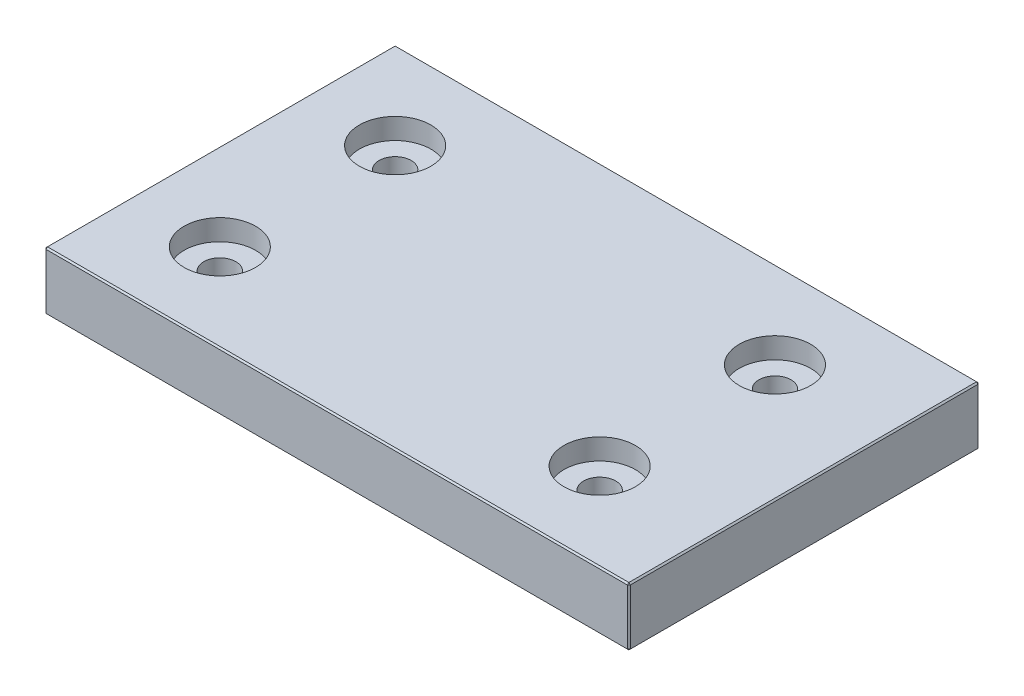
ISO-10303-21;
HEADER;
FILE_DESCRIPTION(('STEP AP214'),'2;1');
FILE_NAME('part.step','',(''),(''),'','','');
FILE_SCHEMA(('AUTOMOTIVE_DESIGN { 1 0 10303 214 1 1 1 1 }'));
ENDSEC;
DATA;
#1=APPLICATION_CONTEXT('core data for automotive mechanical design processes');
#2=APPLICATION_PROTOCOL_DEFINITION('international standard','automotive_design',2000,#1);
#3=PRODUCT_CONTEXT('',#1,'mechanical');
#4=PRODUCT('Part','Part','',(#3));
#5=PRODUCT_RELATED_PRODUCT_CATEGORY('part','',(#4));
#6=PRODUCT_DEFINITION_FORMATION('','',#4);
#7=PRODUCT_DEFINITION_CONTEXT('part definition',#1,'design');
#8=PRODUCT_DEFINITION('design','',#6,#7);
#9=PRODUCT_DEFINITION_SHAPE('','',#8);
#10=(LENGTH_UNIT() NAMED_UNIT(*) SI_UNIT(.MILLI.,.METRE.));
#11=(NAMED_UNIT(*) PLANE_ANGLE_UNIT() SI_UNIT($,.RADIAN.));
#12=(NAMED_UNIT(*) SI_UNIT($,.STERADIAN.) SOLID_ANGLE_UNIT());
#13=UNCERTAINTY_MEASURE_WITH_UNIT(LENGTH_MEASURE(1.E-05),#10,'distance_accuracy_value','');
#14=(GEOMETRIC_REPRESENTATION_CONTEXT(3) GLOBAL_UNCERTAINTY_ASSIGNED_CONTEXT((#13)) GLOBAL_UNIT_ASSIGNED_CONTEXT((#10,
#11,#12)) REPRESENTATION_CONTEXT('',''));
#15=CARTESIAN_POINT('',(0.,0.,0.));
#16=DIRECTION('',(0.,0.,1.));
#17=DIRECTION('',(1.,0.,0.));
#18=AXIS2_PLACEMENT_3D('',#15,#16,#17);
#19=CARTESIAN_POINT('',(30.,10.,-15.));
#20=DIRECTION('',(0.,1.,0.));
#21=DIRECTION('',(0.,0.,1.));
#22=AXIS2_PLACEMENT_3D('',#19,#20,#21);
#23=CYLINDRICAL_SURFACE('',#22,6.12);
#24=CARTESIAN_POINT('',(30.,6.42,-15.));
#25=DIRECTION('',(0.,1.,0.));
#26=DIRECTION('',(0.,0.,1.));
#27=AXIS2_PLACEMENT_3D('',#24,#25,#26);
#28=CIRCLE('',#27,6.12);
#29=CARTESIAN_POINT('',(30.,6.42,-8.88));
#30=VERTEX_POINT('',#29);
#31=EDGE_CURVE('E11',#30,#30,#28,.T.);
#32=ORIENTED_EDGE('',*,*,#31,.F.);
#33=EDGE_LOOP('',(#32));
#34=FACE_BOUND('',#33,.T.);
#35=CARTESIAN_POINT('',(30.,10.,-15.));
#36=DIRECTION('',(0.,1.,0.));
#37=DIRECTION('',(0.,0.,1.));
#38=AXIS2_PLACEMENT_3D('',#35,#36,#37);
#39=CIRCLE('',#38,6.12);
#40=CARTESIAN_POINT('',(30.,10.,-8.88));
#41=VERTEX_POINT('',#40);
#42=EDGE_CURVE('E211',#41,#41,#39,.T.);
#43=ORIENTED_EDGE('',*,*,#42,.T.);
#44=EDGE_LOOP('',(#43));
#45=FACE_BOUND('',#44,.T.);
#46=ADVANCED_FACE('F32',(#34,#45),#23,.F.);
#47=CARTESIAN_POINT('',(32.75,6.42,-15.));
#48=DIRECTION('',(0.,-1.,0.));
#49=DIRECTION('',(0.,0.,-1.));
#50=AXIS2_PLACEMENT_3D('',#47,#48,#49);
#51=PLANE('',#50);
#52=CARTESIAN_POINT('',(30.,6.42,-15.));
#53=DIRECTION('',(0.,1.,0.));
#54=DIRECTION('',(0.,0.,1.));
#55=AXIS2_PLACEMENT_3D('',#52,#53,#54);
#56=CIRCLE('',#55,2.75);
#57=CARTESIAN_POINT('',(30.,6.42,-12.25));
#58=VERTEX_POINT('',#57);
#59=EDGE_CURVE('E39',#58,#58,#56,.T.);
#60=ORIENTED_EDGE('',*,*,#59,.F.);
#61=EDGE_LOOP('',(#60));
#62=FACE_BOUND('',#61,.T.);
#63=ORIENTED_EDGE('',*,*,#31,.T.);
#64=EDGE_LOOP('',(#63));
#65=FACE_BOUND('',#64,.T.);
#66=ADVANCED_FACE('F221',(#62,#65),#51,.F.);
#67=CARTESIAN_POINT('',(30.,10.,-15.));
#68=DIRECTION('',(0.,1.,0.));
#69=DIRECTION('',(0.,0.,1.));
#70=AXIS2_PLACEMENT_3D('',#67,#68,#69);
#71=CYLINDRICAL_SURFACE('',#70,2.75000000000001);
#72=CARTESIAN_POINT('',(30.,0.,-15.));
#73=DIRECTION('',(0.,1.,0.));
#74=DIRECTION('',(0.,0.,1.));
#75=AXIS2_PLACEMENT_3D('',#72,#73,#74);
#76=CIRCLE('',#75,2.75000000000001);
#77=CARTESIAN_POINT('',(30.,0.,-12.25));
#78=VERTEX_POINT('',#77);
#79=EDGE_CURVE('E214',#78,#78,#76,.T.);
#80=ORIENTED_EDGE('',*,*,#79,.F.);
#81=EDGE_LOOP('',(#80));
#82=FACE_BOUND('',#81,.T.);
#83=ORIENTED_EDGE('',*,*,#59,.T.);
#84=EDGE_LOOP('',(#83));
#85=FACE_BOUND('',#84,.T.);
#86=ADVANCED_FACE('F219',(#82,#85),#71,.F.);
#87=CARTESIAN_POINT('',(-35.,10.,-15.));
#88=DIRECTION('',(0.,1.,0.));
#89=DIRECTION('',(0.,0.,1.));
#90=AXIS2_PLACEMENT_3D('',#87,#88,#89);
#91=CYLINDRICAL_SURFACE('',#90,6.12);
#92=CARTESIAN_POINT('',(-35.,6.42,-15.));
#93=DIRECTION('',(0.,1.,0.));
#94=DIRECTION('',(0.,0.,1.));
#95=AXIS2_PLACEMENT_3D('',#92,#93,#94);
#96=CIRCLE('',#95,6.12);
#97=CARTESIAN_POINT('',(-35.,6.42,-8.88));
#98=VERTEX_POINT('',#97);
#99=EDGE_CURVE('E208',#98,#98,#96,.T.);
#100=ORIENTED_EDGE('',*,*,#99,.F.);
#101=EDGE_LOOP('',(#100));
#102=FACE_BOUND('',#101,.T.);
#103=CARTESIAN_POINT('',(-35.,10.,-15.));
#104=DIRECTION('',(0.,1.,0.));
#105=DIRECTION('',(0.,0.,1.));
#106=AXIS2_PLACEMENT_3D('',#103,#104,#105);
#107=CIRCLE('',#106,6.12);
#108=CARTESIAN_POINT('',(-35.,10.,-8.88));
#109=VERTEX_POINT('',#108);
#110=EDGE_CURVE('E198',#109,#109,#107,.T.);
#111=ORIENTED_EDGE('',*,*,#110,.T.);
#112=EDGE_LOOP('',(#111));
#113=FACE_BOUND('',#112,.T.);
#114=ADVANCED_FACE('F340',(#102,#113),#91,.F.);
#115=CARTESIAN_POINT('',(-32.25,6.42,-15.));
#116=DIRECTION('',(0.,-1.,0.));
#117=DIRECTION('',(0.,0.,-1.));
#118=AXIS2_PLACEMENT_3D('',#115,#116,#117);
#119=PLANE('',#118);
#120=CARTESIAN_POINT('',(-35.,6.42,-15.));
#121=DIRECTION('',(0.,1.,0.));
#122=DIRECTION('',(0.,0.,1.));
#123=AXIS2_PLACEMENT_3D('',#120,#121,#122);
#124=CIRCLE('',#123,2.75);
#125=CARTESIAN_POINT('',(-35.,6.42,-12.25));
#126=VERTEX_POINT('',#125);
#127=EDGE_CURVE('E205',#126,#126,#124,.T.);
#128=ORIENTED_EDGE('',*,*,#127,.F.);
#129=EDGE_LOOP('',(#128));
#130=FACE_BOUND('',#129,.T.);
#131=ORIENTED_EDGE('',*,*,#99,.T.);
#132=EDGE_LOOP('',(#131));
#133=FACE_BOUND('',#132,.T.);
#134=ADVANCED_FACE('F336',(#130,#133),#119,.F.);
#135=CARTESIAN_POINT('',(-35.,10.,-15.));
#136=DIRECTION('',(0.,1.,0.));
#137=DIRECTION('',(0.,0.,1.));
#138=AXIS2_PLACEMENT_3D('',#135,#136,#137);
#139=CYLINDRICAL_SURFACE('',#138,2.75000000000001);
#140=CARTESIAN_POINT('',(-35.,0.,-15.));
#141=DIRECTION('',(0.,1.,0.));
#142=DIRECTION('',(0.,0.,1.));
#143=AXIS2_PLACEMENT_3D('',#140,#141,#142);
#144=CIRCLE('',#143,2.75000000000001);
#145=CARTESIAN_POINT('',(-35.,0.,-12.25));
#146=VERTEX_POINT('',#145);
#147=EDGE_CURVE('E201',#146,#146,#144,.T.);
#148=ORIENTED_EDGE('',*,*,#147,.F.);
#149=EDGE_LOOP('',(#148));
#150=FACE_BOUND('',#149,.T.);
#151=ORIENTED_EDGE('',*,*,#127,.T.);
#152=EDGE_LOOP('',(#151));
#153=FACE_BOUND('',#152,.T.);
#154=ADVANCED_FACE('F259',(#150,#153),#139,.F.);
#155=CARTESIAN_POINT('',(50.,10.,30.));
#156=DIRECTION('',(-1.,0.,0.));
#157=DIRECTION('',(0.,0.,1.));
#158=AXIS2_PLACEMENT_3D('',#155,#156,#157);
#159=PLANE('',#158);
#160=DIRECTION('',(0.,0.,-1.));
#161=VECTOR('',#160,1.);
#162=CARTESIAN_POINT('',(50.,0.25,-30.));
#163=LINE('',#162,#161);
#164=CARTESIAN_POINT('',(50.,0.25,29.75));
#165=VERTEX_POINT('',#164);
#166=CARTESIAN_POINT('',(50.,0.25,-29.75));
#167=VERTEX_POINT('',#166);
#168=EDGE_CURVE('E633',#165,#167,#163,.T.);
#169=ORIENTED_EDGE('',*,*,#168,.T.);
#170=DIRECTION('',(0.,1.,0.));
#171=VECTOR('',#170,1.);
#172=CARTESIAN_POINT('',(50.,10.,-29.75));
#173=LINE('',#172,#171);
#174=CARTESIAN_POINT('',(50.,9.75,-29.75));
#175=VERTEX_POINT('',#174);
#176=EDGE_CURVE('E635',#167,#175,#173,.T.);
#177=ORIENTED_EDGE('',*,*,#176,.T.);
#178=DIRECTION('',(0.,0.,1.));
#179=VECTOR('',#178,1.);
#180=CARTESIAN_POINT('',(50.,9.75,30.));
#181=LINE('',#180,#179);
#182=CARTESIAN_POINT('',(50.,9.75,29.75));
#183=VERTEX_POINT('',#182);
#184=EDGE_CURVE('E631',#175,#183,#181,.T.);
#185=ORIENTED_EDGE('',*,*,#184,.T.);
#186=DIRECTION('',(0.,-1.,0.));
#187=VECTOR('',#186,1.);
#188=CARTESIAN_POINT('',(50.,10.,29.75));
#189=LINE('',#188,#187);
#190=EDGE_CURVE('E629',#183,#165,#189,.T.);
#191=ORIENTED_EDGE('',*,*,#190,.T.);
#192=EDGE_LOOP('',(#169,#177,#185,#191));
#193=FACE_BOUND('',#192,.T.);
#194=ADVANCED_FACE('F256',(#193),#159,.F.);
#195=CARTESIAN_POINT('',(-50.,10.,-30.));
#196=DIRECTION('',(0.,0.,1.));
#197=DIRECTION('',(1.,0.,0.));
#198=AXIS2_PLACEMENT_3D('',#195,#196,#197);
#199=PLANE('',#198);
#200=DIRECTION('',(0.,-1.,0.));
#201=VECTOR('',#200,1.);
#202=CARTESIAN_POINT('',(49.75,10.,-30.));
#203=LINE('',#202,#201);
#204=CARTESIAN_POINT('',(49.75,9.75,-30.));
#205=VERTEX_POINT('',#204);
#206=CARTESIAN_POINT('',(49.75,0.25,-30.));
#207=VERTEX_POINT('',#206);
#208=EDGE_CURVE('E129',#205,#207,#203,.T.);
#209=ORIENTED_EDGE('',*,*,#208,.T.);
#210=DIRECTION('',(-1.,0.,0.));
#211=VECTOR('',#210,1.);
#212=CARTESIAN_POINT('',(-50.,0.25,-30.));
#213=LINE('',#212,#211);
#214=CARTESIAN_POINT('',(-49.75,0.25,-30.));
#215=VERTEX_POINT('',#214);
#216=EDGE_CURVE('E125',#207,#215,#213,.T.);
#217=ORIENTED_EDGE('',*,*,#216,.T.);
#218=DIRECTION('',(0.,1.,0.));
#219=VECTOR('',#218,1.);
#220=CARTESIAN_POINT('',(-49.75,10.,-30.));
#221=LINE('',#220,#219);
#222=CARTESIAN_POINT('',(-49.75,9.75,-30.));
#223=VERTEX_POINT('',#222);
#224=EDGE_CURVE('E119',#215,#223,#221,.T.);
#225=ORIENTED_EDGE('',*,*,#224,.T.);
#226=DIRECTION('',(1.,0.,0.));
#227=VECTOR('',#226,1.);
#228=CARTESIAN_POINT('',(-50.,9.75,-30.));
#229=LINE('',#228,#227);
#230=EDGE_CURVE('E122',#223,#205,#229,.T.);
#231=ORIENTED_EDGE('',*,*,#230,.T.);
#232=EDGE_LOOP('',(#209,#217,#225,#231));
#233=FACE_BOUND('',#232,.T.);
#234=ADVANCED_FACE('F121',(#233),#199,.F.);
#235=CARTESIAN_POINT('',(-50.,10.,30.));
#236=DIRECTION('',(1.,0.,0.));
#237=DIRECTION('',(0.,0.,-1.));
#238=AXIS2_PLACEMENT_3D('',#235,#236,#237);
#239=PLANE('',#238);
#240=DIRECTION('',(0.,0.,-1.));
#241=VECTOR('',#240,1.);
#242=CARTESIAN_POINT('',(-50.,9.75,30.));
#243=LINE('',#242,#241);
#244=CARTESIAN_POINT('',(-50.,9.75,29.75));
#245=VERTEX_POINT('',#244);
#246=CARTESIAN_POINT('',(-50.,9.75,-29.75));
#247=VERTEX_POINT('',#246);
#248=EDGE_CURVE('E624',#245,#247,#243,.T.);
#249=ORIENTED_EDGE('',*,*,#248,.T.);
#250=DIRECTION('',(0.,-1.,0.));
#251=VECTOR('',#250,1.);
#252=CARTESIAN_POINT('',(-50.,10.,-29.75));
#253=LINE('',#252,#251);
#254=CARTESIAN_POINT('',(-50.,0.25,-29.75));
#255=VERTEX_POINT('',#254);
#256=EDGE_CURVE('E153',#247,#255,#253,.T.);
#257=ORIENTED_EDGE('',*,*,#256,.T.);
#258=DIRECTION('',(0.,0.,1.));
#259=VECTOR('',#258,1.);
#260=CARTESIAN_POINT('',(-50.,0.25,30.));
#261=LINE('',#260,#259);
#262=CARTESIAN_POINT('',(-50.,0.25,29.75));
#263=VERTEX_POINT('',#262);
#264=EDGE_CURVE('E626',#255,#263,#261,.T.);
#265=ORIENTED_EDGE('',*,*,#264,.T.);
#266=DIRECTION('',(0.,1.,0.));
#267=VECTOR('',#266,1.);
#268=CARTESIAN_POINT('',(-50.,10.,29.75));
#269=LINE('',#268,#267);
#270=EDGE_CURVE('E622',#263,#245,#269,.T.);
#271=ORIENTED_EDGE('',*,*,#270,.T.);
#272=EDGE_LOOP('',(#249,#257,#265,#271));
#273=FACE_BOUND('',#272,.T.);
#274=ADVANCED_FACE('F243',(#273),#239,.F.);
#275=CARTESIAN_POINT('',(-50.,10.,30.));
#276=DIRECTION('',(0.,0.,-1.));
#277=DIRECTION('',(-1.,0.,0.));
#278=AXIS2_PLACEMENT_3D('',#275,#276,#277);
#279=PLANE('',#278);
#280=DIRECTION('',(-1.,0.,0.));
#281=VECTOR('',#280,1.);
#282=CARTESIAN_POINT('',(-50.,9.75,30.));
#283=LINE('',#282,#281);
#284=CARTESIAN_POINT('',(49.75,9.75,30.));
#285=VERTEX_POINT('',#284);
#286=CARTESIAN_POINT('',(-49.75,9.75,30.));
#287=VERTEX_POINT('',#286);
#288=EDGE_CURVE('E46',#285,#287,#283,.T.);
#289=ORIENTED_EDGE('',*,*,#288,.T.);
#290=DIRECTION('',(0.,-1.,0.));
#291=VECTOR('',#290,1.);
#292=CARTESIAN_POINT('',(-49.75,10.,30.));
#293=LINE('',#292,#291);
#294=CARTESIAN_POINT('',(-49.75,0.25,30.));
#295=VERTEX_POINT('',#294);
#296=EDGE_CURVE('E202',#287,#295,#293,.T.);
#297=ORIENTED_EDGE('',*,*,#296,.T.);
#298=DIRECTION('',(1.,0.,0.));
#299=VECTOR('',#298,1.);
#300=CARTESIAN_POINT('',(50.,0.25,30.));
#301=LINE('',#300,#299);
#302=CARTESIAN_POINT('',(49.75,0.25,30.));
#303=VERTEX_POINT('',#302);
#304=EDGE_CURVE('E647',#295,#303,#301,.T.);
#305=ORIENTED_EDGE('',*,*,#304,.T.);
#306=DIRECTION('',(0.,1.,0.));
#307=VECTOR('',#306,1.);
#308=CARTESIAN_POINT('',(49.75,10.,30.));
#309=LINE('',#308,#307);
#310=EDGE_CURVE('E51',#303,#285,#309,.T.);
#311=ORIENTED_EDGE('',*,*,#310,.T.);
#312=EDGE_LOOP('',(#289,#297,#305,#311));
#313=FACE_BOUND('',#312,.T.);
#314=ADVANCED_FACE('F233',(#313),#279,.F.);
#315=CARTESIAN_POINT('',(0.,10.,0.));
#316=DIRECTION('',(0.,-1.,0.));
#317=DIRECTION('',(0.,0.,-1.));
#318=AXIS2_PLACEMENT_3D('',#315,#316,#317);
#319=PLANE('',#318);
#320=CARTESIAN_POINT('',(30.,10.,15.));
#321=DIRECTION('',(0.,1.,0.));
#322=DIRECTION('',(0.,0.,1.));
#323=AXIS2_PLACEMENT_3D('',#320,#321,#322);
#324=CIRCLE('',#323,6.12);
#325=CARTESIAN_POINT('',(30.,10.,21.12));
#326=VERTEX_POINT('',#325);
#327=EDGE_CURVE('E588',#326,#326,#324,.T.);
#328=ORIENTED_EDGE('',*,*,#327,.F.);
#329=EDGE_LOOP('',(#328));
#330=FACE_BOUND('',#329,.T.);
#331=CARTESIAN_POINT('',(-35.,10.,15.));
#332=DIRECTION('',(0.,1.,0.));
#333=DIRECTION('',(0.,0.,1.));
#334=AXIS2_PLACEMENT_3D('',#331,#332,#333);
#335=CIRCLE('',#334,6.12);
#336=CARTESIAN_POINT('',(-35.,10.,21.12));
#337=VERTEX_POINT('',#336);
#338=EDGE_CURVE('E598',#337,#337,#335,.T.);
#339=ORIENTED_EDGE('',*,*,#338,.F.);
#340=EDGE_LOOP('',(#339));
#341=FACE_BOUND('',#340,.T.);
#342=DIRECTION('',(-1.,0.,0.));
#343=VECTOR('',#342,1.);
#344=CARTESIAN_POINT('',(0.,10.,-29.75));
#345=LINE('',#344,#343);
#346=CARTESIAN_POINT('',(49.75,10.,-29.75));
#347=VERTEX_POINT('',#346);
#348=CARTESIAN_POINT('',(-49.75,10.,-29.75));
#349=VERTEX_POINT('',#348);
#350=EDGE_CURVE('E642',#347,#349,#345,.T.);
#351=ORIENTED_EDGE('',*,*,#350,.T.);
#352=DIRECTION('',(0.,0.,1.));
#353=VECTOR('',#352,1.);
#354=CARTESIAN_POINT('',(-49.75,10.,0.));
#355=LINE('',#354,#353);
#356=CARTESIAN_POINT('',(-49.75,10.,29.75));
#357=VERTEX_POINT('',#356);
#358=EDGE_CURVE('E644',#349,#357,#355,.T.);
#359=ORIENTED_EDGE('',*,*,#358,.T.);
#360=DIRECTION('',(1.,0.,0.));
#361=VECTOR('',#360,1.);
#362=CARTESIAN_POINT('',(0.,10.,29.75));
#363=LINE('',#362,#361);
#364=CARTESIAN_POINT('',(49.75,10.,29.75));
#365=VERTEX_POINT('',#364);
#366=EDGE_CURVE('E638',#357,#365,#363,.T.);
#367=ORIENTED_EDGE('',*,*,#366,.T.);
#368=DIRECTION('',(0.,0.,-1.));
#369=VECTOR('',#368,1.);
#370=CARTESIAN_POINT('',(49.75,10.,0.));
#371=LINE('',#370,#369);
#372=EDGE_CURVE('E640',#365,#347,#371,.T.);
#373=ORIENTED_EDGE('',*,*,#372,.T.);
#374=EDGE_LOOP('',(#351,#359,#367,#373));
#375=FACE_BOUND('',#374,.T.);
#376=ORIENTED_EDGE('',*,*,#110,.F.);
#377=EDGE_LOOP('',(#376));
#378=FACE_BOUND('',#377,.T.);
#379=ORIENTED_EDGE('',*,*,#42,.F.);
#380=EDGE_LOOP('',(#379));
#381=FACE_BOUND('',#380,.T.);
#382=ADVANCED_FACE('F230',(#330,#341,#375,#378,#381),#319,.F.);
#383=CARTESIAN_POINT('',(0.,0.,0.));
#384=DIRECTION('',(0.,-1.,0.));
#385=DIRECTION('',(0.,0.,-1.));
#386=AXIS2_PLACEMENT_3D('',#383,#384,#385);
#387=PLANE('',#386);
#388=CARTESIAN_POINT('',(30.,0.,15.));
#389=DIRECTION('',(0.,1.,0.));
#390=DIRECTION('',(0.,0.,1.));
#391=AXIS2_PLACEMENT_3D('',#388,#389,#390);
#392=CIRCLE('',#391,2.75000000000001);
#393=CARTESIAN_POINT('',(30.,0.,17.75));
#394=VERTEX_POINT('',#393);
#395=EDGE_CURVE('E589',#394,#394,#392,.T.);
#396=ORIENTED_EDGE('',*,*,#395,.T.);
#397=EDGE_LOOP('',(#396));
#398=FACE_BOUND('',#397,.T.);
#399=CARTESIAN_POINT('',(-35.,0.,15.));
#400=DIRECTION('',(0.,1.,0.));
#401=DIRECTION('',(0.,0.,1.));
#402=AXIS2_PLACEMENT_3D('',#399,#400,#401);
#403=CIRCLE('',#402,2.75000000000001);
#404=CARTESIAN_POINT('',(-35.,0.,17.75));
#405=VERTEX_POINT('',#404);
#406=EDGE_CURVE('E607',#405,#405,#403,.T.);
#407=ORIENTED_EDGE('',*,*,#406,.T.);
#408=EDGE_LOOP('',(#407));
#409=FACE_BOUND('',#408,.T.);
#410=DIRECTION('',(0.,0.,-1.));
#411=VECTOR('',#410,1.);
#412=CARTESIAN_POINT('',(-49.75,0.,-30.));
#413=LINE('',#412,#411);
#414=CARTESIAN_POINT('',(-49.75,0.,29.75));
#415=VERTEX_POINT('',#414);
#416=CARTESIAN_POINT('',(-49.75,0.,-29.75));
#417=VERTEX_POINT('',#416);
#418=EDGE_CURVE('E617',#415,#417,#413,.T.);
#419=ORIENTED_EDGE('',*,*,#418,.T.);
#420=DIRECTION('',(1.,0.,0.));
#421=VECTOR('',#420,1.);
#422=CARTESIAN_POINT('',(50.,0.,-29.75));
#423=LINE('',#422,#421);
#424=CARTESIAN_POINT('',(49.75,0.,-29.75));
#425=VERTEX_POINT('',#424);
#426=EDGE_CURVE('E619',#417,#425,#423,.T.);
#427=ORIENTED_EDGE('',*,*,#426,.T.);
#428=DIRECTION('',(0.,0.,1.));
#429=VECTOR('',#428,1.);
#430=CARTESIAN_POINT('',(49.75,0.,30.));
#431=LINE('',#430,#429);
#432=CARTESIAN_POINT('',(49.75,0.,29.75));
#433=VERTEX_POINT('',#432);
#434=EDGE_CURVE('E615',#425,#433,#431,.T.);
#435=ORIENTED_EDGE('',*,*,#434,.T.);
#436=DIRECTION('',(-1.,0.,0.));
#437=VECTOR('',#436,1.);
#438=CARTESIAN_POINT('',(-50.,0.,29.75));
#439=LINE('',#438,#437);
#440=EDGE_CURVE('E613',#433,#415,#439,.T.);
#441=ORIENTED_EDGE('',*,*,#440,.T.);
#442=EDGE_LOOP('',(#419,#427,#435,#441));
#443=FACE_BOUND('',#442,.T.);
#444=ORIENTED_EDGE('',*,*,#147,.T.);
#445=EDGE_LOOP('',(#444));
#446=FACE_BOUND('',#445,.T.);
#447=ORIENTED_EDGE('',*,*,#79,.T.);
#448=EDGE_LOOP('',(#447));
#449=FACE_BOUND('',#448,.T.);
#450=ADVANCED_FACE('F232',(#398,#409,#443,#446,#449),#387,.T.);
#451=CARTESIAN_POINT('',(0.,10.,29.75));
#452=DIRECTION('',(0.,-0.707106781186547,-0.707106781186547));
#453=DIRECTION('',(1.,0.,0.));
#454=AXIS2_PLACEMENT_3D('',#451,#452,#453);
#455=PLANE('',#454);
#456=DIRECTION('',(0.,0.707106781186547,-0.707106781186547));
#457=VECTOR('',#456,1.);
#458=CARTESIAN_POINT('',(49.75,9.875,29.875));
#459=LINE('',#458,#457);
#460=EDGE_CURVE('E141',#365,#285,#459,.F.);
#461=ORIENTED_EDGE('',*,*,#460,.F.);
#462=ORIENTED_EDGE('',*,*,#366,.F.);
#463=DIRECTION('',(0.,-0.707106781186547,0.707106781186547));
#464=VECTOR('',#463,1.);
#465=CARTESIAN_POINT('',(-49.75,10.,29.75));
#466=LINE('',#465,#464);
#467=EDGE_CURVE('E193',#287,#357,#466,.F.);
#468=ORIENTED_EDGE('',*,*,#467,.F.);
#469=ORIENTED_EDGE('',*,*,#288,.F.);
#470=EDGE_LOOP('',(#461,#462,#468,#469));
#471=FACE_BOUND('',#470,.T.);
#472=ADVANCED_FACE('F240',(#471),#455,.F.);
#473=CARTESIAN_POINT('',(50.,9.75,29.75));
#474=DIRECTION('',(0.577350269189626,0.577350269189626,0.577350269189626));
#475=DIRECTION('',(0.707106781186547,0.,-0.707106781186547));
#476=AXIS2_PLACEMENT_3D('',#473,#474,#475);
#477=PLANE('',#476);
#478=DIRECTION('',(0.707106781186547,-0.707106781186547,0.));
#479=VECTOR('',#478,1.);
#480=CARTESIAN_POINT('',(50.,9.75,29.75));
#481=LINE('',#480,#479);
#482=EDGE_CURVE('E187',#365,#183,#481,.T.);
#483=ORIENTED_EDGE('',*,*,#482,.F.);
#484=ORIENTED_EDGE('',*,*,#460,.T.);
#485=DIRECTION('',(-0.707106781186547,0.,0.707106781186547));
#486=VECTOR('',#485,1.);
#487=CARTESIAN_POINT('',(50.,9.75,29.75));
#488=LINE('',#487,#486);
#489=EDGE_CURVE('E190',#183,#285,#488,.T.);
#490=ORIENTED_EDGE('',*,*,#489,.F.);
#491=EDGE_LOOP('',(#483,#484,#490));
#492=FACE_BOUND('',#491,.T.);
#493=ADVANCED_FACE('F326',(#492),#477,.T.);
#494=CARTESIAN_POINT('',(-49.75,10.,29.75));
#495=DIRECTION('',(-0.577350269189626,0.577350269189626,0.577350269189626));
#496=DIRECTION('',(0.707106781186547,0.,0.707106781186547));
#497=AXIS2_PLACEMENT_3D('',#494,#495,#496);
#498=PLANE('',#497);
#499=DIRECTION('',(-0.707106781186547,0.,-0.707106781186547));
#500=VECTOR('',#499,1.);
#501=CARTESIAN_POINT('',(-49.875,9.75,29.875));
#502=LINE('',#501,#500);
#503=EDGE_CURVE('E182',#287,#245,#502,.T.);
#504=ORIENTED_EDGE('',*,*,#503,.F.);
#505=ORIENTED_EDGE('',*,*,#467,.T.);
#506=DIRECTION('',(0.707106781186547,0.707106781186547,0.));
#507=VECTOR('',#506,1.);
#508=CARTESIAN_POINT('',(-49.75,10.,29.75));
#509=LINE('',#508,#507);
#510=EDGE_CURVE('E185',#245,#357,#509,.T.);
#511=ORIENTED_EDGE('',*,*,#510,.F.);
#512=EDGE_LOOP('',(#504,#505,#511));
#513=FACE_BOUND('',#512,.T.);
#514=ADVANCED_FACE('F322',(#513),#498,.T.);
#515=CARTESIAN_POINT('',(50.,10.,29.75));
#516=DIRECTION('',(-0.707106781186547,0.,-0.707106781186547));
#517=DIRECTION('',(0.,-1.,0.));
#518=AXIS2_PLACEMENT_3D('',#515,#516,#517);
#519=PLANE('',#518);
#520=ORIENTED_EDGE('',*,*,#489,.T.);
#521=ORIENTED_EDGE('',*,*,#310,.F.);
#522=DIRECTION('',(0.707106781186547,0.,-0.707106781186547));
#523=VECTOR('',#522,1.);
#524=CARTESIAN_POINT('',(49.875,0.25,29.875));
#525=LINE('',#524,#523);
#526=EDGE_CURVE('E176',#165,#303,#525,.F.);
#527=ORIENTED_EDGE('',*,*,#526,.F.);
#528=ORIENTED_EDGE('',*,*,#190,.F.);
#529=EDGE_LOOP('',(#520,#521,#527,#528));
#530=FACE_BOUND('',#529,.T.);
#531=ADVANCED_FACE('F318',(#530),#519,.F.);
#532=CARTESIAN_POINT('',(49.75,10.,0.));
#533=DIRECTION('',(-0.707106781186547,-0.707106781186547,0.));
#534=DIRECTION('',(0.,0.,-1.));
#535=AXIS2_PLACEMENT_3D('',#532,#533,#534);
#536=PLANE('',#535);
#537=ORIENTED_EDGE('',*,*,#482,.T.);
#538=ORIENTED_EDGE('',*,*,#184,.F.);
#539=DIRECTION('',(-0.707106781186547,0.707106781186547,0.));
#540=VECTOR('',#539,1.);
#541=CARTESIAN_POINT('',(50.,9.75,-29.75));
#542=LINE('',#541,#540);
#543=EDGE_CURVE('E173',#347,#175,#542,.F.);
#544=ORIENTED_EDGE('',*,*,#543,.F.);
#545=ORIENTED_EDGE('',*,*,#372,.F.);
#546=EDGE_LOOP('',(#537,#538,#544,#545));
#547=FACE_BOUND('',#546,.T.);
#548=ADVANCED_FACE('F315',(#547),#536,.F.);
#549=CARTESIAN_POINT('',(0.,10.,-29.75));
#550=DIRECTION('',(0.,-0.707106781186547,0.707106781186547));
#551=DIRECTION('',(-1.,0.,0.));
#552=AXIS2_PLACEMENT_3D('',#549,#550,#551);
#553=PLANE('',#552);
#554=DIRECTION('',(0.,0.707106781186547,0.707106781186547));
#555=VECTOR('',#554,1.);
#556=CARTESIAN_POINT('',(-49.75,9.75,-30.));
#557=LINE('',#556,#555);
#558=EDGE_CURVE('E136',#349,#223,#557,.F.);
#559=ORIENTED_EDGE('',*,*,#558,.F.);
#560=ORIENTED_EDGE('',*,*,#350,.F.);
#561=DIRECTION('',(0.,-0.707106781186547,-0.707106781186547));
#562=VECTOR('',#561,1.);
#563=CARTESIAN_POINT('',(49.75,9.875,-29.875));
#564=LINE('',#563,#562);
#565=EDGE_CURVE('E139',#205,#347,#564,.F.);
#566=ORIENTED_EDGE('',*,*,#565,.F.);
#567=ORIENTED_EDGE('',*,*,#230,.F.);
#568=EDGE_LOOP('',(#559,#560,#566,#567));
#569=FACE_BOUND('',#568,.T.);
#570=ADVANCED_FACE('F134',(#569),#553,.F.);
#571=CARTESIAN_POINT('',(-49.75,10.,0.));
#572=DIRECTION('',(0.707106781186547,-0.707106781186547,0.));
#573=DIRECTION('',(0.,0.,1.));
#574=AXIS2_PLACEMENT_3D('',#571,#572,#573);
#575=PLANE('',#574);
#576=ORIENTED_EDGE('',*,*,#510,.T.);
#577=ORIENTED_EDGE('',*,*,#358,.F.);
#578=DIRECTION('',(-0.707106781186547,-0.707106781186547,0.));
#579=VECTOR('',#578,1.);
#580=CARTESIAN_POINT('',(-49.875,9.875,-29.75));
#581=LINE('',#580,#579);
#582=EDGE_CURVE('E149',#247,#349,#581,.F.);
#583=ORIENTED_EDGE('',*,*,#582,.F.);
#584=ORIENTED_EDGE('',*,*,#248,.F.);
#585=EDGE_LOOP('',(#576,#577,#583,#584));
#586=FACE_BOUND('',#585,.T.);
#587=ADVANCED_FACE('F308',(#586),#575,.F.);
#588=CARTESIAN_POINT('',(-49.75,10.,30.));
#589=DIRECTION('',(0.707106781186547,0.,-0.707106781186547));
#590=DIRECTION('',(0.,-1.,0.));
#591=AXIS2_PLACEMENT_3D('',#588,#589,#590);
#592=PLANE('',#591);
#593=ORIENTED_EDGE('',*,*,#503,.T.);
#594=ORIENTED_EDGE('',*,*,#270,.F.);
#595=DIRECTION('',(0.707106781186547,0.,0.707106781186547));
#596=VECTOR('',#595,1.);
#597=CARTESIAN_POINT('',(-50.,0.25,29.75));
#598=LINE('',#597,#596);
#599=EDGE_CURVE('E168',#295,#263,#598,.F.);
#600=ORIENTED_EDGE('',*,*,#599,.F.);
#601=ORIENTED_EDGE('',*,*,#296,.F.);
#602=EDGE_LOOP('',(#593,#594,#600,#601));
#603=FACE_BOUND('',#602,.T.);
#604=ADVANCED_FACE('F304',(#603),#592,.F.);
#605=CARTESIAN_POINT('',(-50.,0.25,30.));
#606=DIRECTION('',(0.,-0.707106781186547,0.707106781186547));
#607=DIRECTION('',(-1.,0.,0.));
#608=AXIS2_PLACEMENT_3D('',#605,#606,#607);
#609=PLANE('',#608);
#610=DIRECTION('',(0.,-0.707106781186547,-0.707106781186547));
#611=VECTOR('',#610,1.);
#612=CARTESIAN_POINT('',(49.75,0.,29.75));
#613=LINE('',#612,#611);
#614=EDGE_CURVE('E179',#303,#433,#613,.T.);
#615=ORIENTED_EDGE('',*,*,#614,.F.);
#616=ORIENTED_EDGE('',*,*,#304,.F.);
#617=DIRECTION('',(0.,0.707106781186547,0.707106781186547));
#618=VECTOR('',#617,1.);
#619=CARTESIAN_POINT('',(-49.75,0.125,29.875));
#620=LINE('',#619,#618);
#621=EDGE_CURVE('E166',#415,#295,#620,.T.);
#622=ORIENTED_EDGE('',*,*,#621,.F.);
#623=ORIENTED_EDGE('',*,*,#440,.F.);
#624=EDGE_LOOP('',(#615,#616,#622,#623));
#625=FACE_BOUND('',#624,.T.);
#626=ADVANCED_FACE('F300',(#625),#609,.T.);
#627=CARTESIAN_POINT('',(49.75,0.,29.75));
#628=DIRECTION('',(0.577350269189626,-0.577350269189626,0.577350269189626));
#629=DIRECTION('',(0.707106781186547,0.,-0.707106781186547));
#630=AXIS2_PLACEMENT_3D('',#627,#628,#629);
#631=PLANE('',#630);
#632=ORIENTED_EDGE('',*,*,#526,.T.);
#633=ORIENTED_EDGE('',*,*,#614,.T.);
#634=DIRECTION('',(0.707106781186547,0.707106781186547,0.));
#635=VECTOR('',#634,1.);
#636=CARTESIAN_POINT('',(49.75,0.,29.75));
#637=LINE('',#636,#635);
#638=EDGE_CURVE('E157',#165,#433,#637,.F.);
#639=ORIENTED_EDGE('',*,*,#638,.F.);
#640=EDGE_LOOP('',(#632,#633,#639));
#641=FACE_BOUND('',#640,.T.);
#642=ADVANCED_FACE('F296',(#641),#631,.T.);
#643=CARTESIAN_POINT('',(50.,9.75,-29.75));
#644=DIRECTION('',(0.577350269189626,0.577350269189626,-0.577350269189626));
#645=DIRECTION('',(-0.707106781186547,0.,-0.707106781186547));
#646=AXIS2_PLACEMENT_3D('',#643,#644,#645);
#647=PLANE('',#646);
#648=ORIENTED_EDGE('',*,*,#565,.T.);
#649=ORIENTED_EDGE('',*,*,#543,.T.);
#650=DIRECTION('',(0.707106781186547,0.,0.707106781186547));
#651=VECTOR('',#650,1.);
#652=CARTESIAN_POINT('',(50.,9.75,-29.75));
#653=LINE('',#652,#651);
#654=EDGE_CURVE('E154',#205,#175,#653,.T.);
#655=ORIENTED_EDGE('',*,*,#654,.F.);
#656=EDGE_LOOP('',(#648,#649,#655));
#657=FACE_BOUND('',#656,.T.);
#658=ADVANCED_FACE('F293',(#657),#647,.T.);
#659=CARTESIAN_POINT('',(-49.75,9.75,-30.));
#660=DIRECTION('',(-0.577350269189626,0.577350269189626,-0.577350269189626));
#661=DIRECTION('',(-0.707106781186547,0.,0.707106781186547));
#662=AXIS2_PLACEMENT_3D('',#659,#660,#661);
#663=PLANE('',#662);
#664=ORIENTED_EDGE('',*,*,#582,.T.);
#665=ORIENTED_EDGE('',*,*,#558,.T.);
#666=DIRECTION('',(0.707106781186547,0.,-0.707106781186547));
#667=VECTOR('',#666,1.);
#668=CARTESIAN_POINT('',(-49.75,9.75,-30.));
#669=LINE('',#668,#667);
#670=EDGE_CURVE('E146',#247,#223,#669,.T.);
#671=ORIENTED_EDGE('',*,*,#670,.F.);
#672=EDGE_LOOP('',(#664,#665,#671));
#673=FACE_BOUND('',#672,.T.);
#674=ADVANCED_FACE('F145',(#673),#663,.T.);
#675=CARTESIAN_POINT('',(-50.,0.25,29.75));
#676=DIRECTION('',(-0.577350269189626,-0.577350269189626,0.577350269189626));
#677=DIRECTION('',(0.707106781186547,0.,0.707106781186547));
#678=AXIS2_PLACEMENT_3D('',#675,#676,#677);
#679=PLANE('',#678);
#680=ORIENTED_EDGE('',*,*,#621,.T.);
#681=ORIENTED_EDGE('',*,*,#599,.T.);
#682=DIRECTION('',(0.707106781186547,-0.707106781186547,0.));
#683=VECTOR('',#682,1.);
#684=CARTESIAN_POINT('',(-50.,0.25,29.75));
#685=LINE('',#684,#683);
#686=EDGE_CURVE('E155',#415,#263,#685,.F.);
#687=ORIENTED_EDGE('',*,*,#686,.F.);
#688=EDGE_LOOP('',(#680,#681,#687));
#689=FACE_BOUND('',#688,.T.);
#690=ADVANCED_FACE('F286',(#689),#679,.T.);
#691=CARTESIAN_POINT('',(50.,0.25,30.));
#692=DIRECTION('',(0.707106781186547,-0.707106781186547,0.));
#693=DIRECTION('',(0.,0.,1.));
#694=AXIS2_PLACEMENT_3D('',#691,#692,#693);
#695=PLANE('',#694);
#696=ORIENTED_EDGE('',*,*,#638,.T.);
#697=ORIENTED_EDGE('',*,*,#434,.F.);
#698=DIRECTION('',(-0.707106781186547,-0.707106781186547,0.));
#699=VECTOR('',#698,1.);
#700=CARTESIAN_POINT('',(49.75,0.,-29.75));
#701=LINE('',#700,#699);
#702=EDGE_CURVE('E160',#167,#425,#701,.T.);
#703=ORIENTED_EDGE('',*,*,#702,.F.);
#704=ORIENTED_EDGE('',*,*,#168,.F.);
#705=EDGE_LOOP('',(#696,#697,#703,#704));
#706=FACE_BOUND('',#705,.T.);
#707=ADVANCED_FACE('F282',(#706),#695,.T.);
#708=CARTESIAN_POINT('',(49.75,10.,-30.));
#709=DIRECTION('',(-0.707106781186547,0.,0.707106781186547));
#710=DIRECTION('',(0.,-1.,0.));
#711=AXIS2_PLACEMENT_3D('',#708,#709,#710);
#712=PLANE('',#711);
#713=ORIENTED_EDGE('',*,*,#654,.T.);
#714=ORIENTED_EDGE('',*,*,#176,.F.);
#715=DIRECTION('',(-0.707106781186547,0.,-0.707106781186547));
#716=VECTOR('',#715,1.);
#717=CARTESIAN_POINT('',(49.875,0.25,-29.875));
#718=LINE('',#717,#716);
#719=EDGE_CURVE('E660',#207,#167,#718,.F.);
#720=ORIENTED_EDGE('',*,*,#719,.F.);
#721=ORIENTED_EDGE('',*,*,#208,.F.);
#722=EDGE_LOOP('',(#713,#714,#720,#721));
#723=FACE_BOUND('',#722,.T.);
#724=ADVANCED_FACE('F279',(#723),#712,.F.);
#725=CARTESIAN_POINT('',(-50.,10.,-29.75));
#726=DIRECTION('',(0.707106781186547,0.,0.707106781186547));
#727=DIRECTION('',(0.,-1.,0.));
#728=AXIS2_PLACEMENT_3D('',#725,#726,#727);
#729=PLANE('',#728);
#730=ORIENTED_EDGE('',*,*,#670,.T.);
#731=ORIENTED_EDGE('',*,*,#224,.F.);
#732=DIRECTION('',(-0.707106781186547,0.,0.707106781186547));
#733=VECTOR('',#732,1.);
#734=CARTESIAN_POINT('',(-49.75,0.25,-30.));
#735=LINE('',#734,#733);
#736=EDGE_CURVE('E657',#255,#215,#735,.F.);
#737=ORIENTED_EDGE('',*,*,#736,.F.);
#738=ORIENTED_EDGE('',*,*,#256,.F.);
#739=EDGE_LOOP('',(#730,#731,#737,#738));
#740=FACE_BOUND('',#739,.T.);
#741=ADVANCED_FACE('F151',(#740),#729,.F.);
#742=CARTESIAN_POINT('',(-50.,0.25,30.));
#743=DIRECTION('',(-0.707106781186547,-0.707106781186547,0.));
#744=DIRECTION('',(0.,0.,-1.));
#745=AXIS2_PLACEMENT_3D('',#742,#743,#744);
#746=PLANE('',#745);
#747=ORIENTED_EDGE('',*,*,#686,.T.);
#748=ORIENTED_EDGE('',*,*,#264,.F.);
#749=DIRECTION('',(-0.707106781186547,0.707106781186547,0.));
#750=VECTOR('',#749,1.);
#751=CARTESIAN_POINT('',(-49.875,0.125,-29.75));
#752=LINE('',#751,#750);
#753=EDGE_CURVE('E655',#417,#255,#752,.T.);
#754=ORIENTED_EDGE('',*,*,#753,.F.);
#755=ORIENTED_EDGE('',*,*,#418,.F.);
#756=EDGE_LOOP('',(#747,#748,#754,#755));
#757=FACE_BOUND('',#756,.T.);
#758=ADVANCED_FACE('F272',(#757),#746,.T.);
#759=CARTESIAN_POINT('',(49.75,0.,-29.75));
#760=DIRECTION('',(0.577350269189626,-0.577350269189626,-0.577350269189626));
#761=DIRECTION('',(-0.707106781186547,0.,-0.707106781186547));
#762=AXIS2_PLACEMENT_3D('',#759,#760,#761);
#763=PLANE('',#762);
#764=ORIENTED_EDGE('',*,*,#719,.T.);
#765=ORIENTED_EDGE('',*,*,#702,.T.);
#766=DIRECTION('',(0.,0.707106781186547,-0.707106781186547));
#767=VECTOR('',#766,1.);
#768=CARTESIAN_POINT('',(49.75,0.,-29.75));
#769=LINE('',#768,#767);
#770=EDGE_CURVE('E653',#207,#425,#769,.F.);
#771=ORIENTED_EDGE('',*,*,#770,.F.);
#772=EDGE_LOOP('',(#764,#765,#771));
#773=FACE_BOUND('',#772,.T.);
#774=ADVANCED_FACE('F268',(#773),#763,.T.);
#775=CARTESIAN_POINT('',(-49.75,0.25,-30.));
#776=DIRECTION('',(-0.577350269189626,-0.577350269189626,-0.577350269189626));
#777=DIRECTION('',(-0.707106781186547,0.,0.707106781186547));
#778=AXIS2_PLACEMENT_3D('',#775,#776,#777);
#779=PLANE('',#778);
#780=ORIENTED_EDGE('',*,*,#753,.T.);
#781=ORIENTED_EDGE('',*,*,#736,.T.);
#782=DIRECTION('',(0.,-0.707106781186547,0.707106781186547));
#783=VECTOR('',#782,1.);
#784=CARTESIAN_POINT('',(-49.75,0.25,-30.));
#785=LINE('',#784,#783);
#786=EDGE_CURVE('E609',#417,#215,#785,.F.);
#787=ORIENTED_EDGE('',*,*,#786,.F.);
#788=EDGE_LOOP('',(#780,#781,#787));
#789=FACE_BOUND('',#788,.T.);
#790=ADVANCED_FACE('F264',(#789),#779,.T.);
#791=CARTESIAN_POINT('',(-50.,0.25,-30.));
#792=DIRECTION('',(0.,-0.707106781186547,-0.707106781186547));
#793=DIRECTION('',(1.,0.,0.));
#794=AXIS2_PLACEMENT_3D('',#791,#792,#793);
#795=PLANE('',#794);
#796=ORIENTED_EDGE('',*,*,#770,.T.);
#797=ORIENTED_EDGE('',*,*,#426,.F.);
#798=ORIENTED_EDGE('',*,*,#786,.T.);
#799=ORIENTED_EDGE('',*,*,#216,.F.);
#800=EDGE_LOOP('',(#796,#797,#798,#799));
#801=FACE_BOUND('',#800,.T.);
#802=ADVANCED_FACE('F261',(#801),#795,.T.);
#803=CARTESIAN_POINT('',(-35.,10.,15.));
#804=DIRECTION('',(0.,1.,0.));
#805=DIRECTION('',(0.,0.,1.));
#806=AXIS2_PLACEMENT_3D('',#803,#804,#805);
#807=CYLINDRICAL_SURFACE('',#806,2.75000000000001);
#808=ORIENTED_EDGE('',*,*,#406,.F.);
#809=EDGE_LOOP('',(#808));
#810=FACE_BOUND('',#809,.T.);
#811=CARTESIAN_POINT('',(-35.,6.42,15.));
#812=DIRECTION('',(0.,1.,0.));
#813=DIRECTION('',(0.,0.,1.));
#814=AXIS2_PLACEMENT_3D('',#811,#812,#813);
#815=CIRCLE('',#814,2.75);
#816=CARTESIAN_POINT('',(-35.,6.42,17.75));
#817=VERTEX_POINT('',#816);
#818=EDGE_CURVE('E604',#817,#817,#815,.T.);
#819=ORIENTED_EDGE('',*,*,#818,.T.);
#820=EDGE_LOOP('',(#819));
#821=FACE_BOUND('',#820,.T.);
#822=ADVANCED_FACE('F248',(#810,#821),#807,.F.);
#823=CARTESIAN_POINT('',(-32.25,6.42,15.));
#824=DIRECTION('',(0.,-1.,0.));
#825=DIRECTION('',(0.,0.,-1.));
#826=AXIS2_PLACEMENT_3D('',#823,#824,#825);
#827=PLANE('',#826);
#828=ORIENTED_EDGE('',*,*,#818,.F.);
#829=EDGE_LOOP('',(#828));
#830=FACE_BOUND('',#829,.T.);
#831=CARTESIAN_POINT('',(-35.,6.42,15.));
#832=DIRECTION('',(0.,1.,0.));
#833=DIRECTION('',(0.,0.,1.));
#834=AXIS2_PLACEMENT_3D('',#831,#832,#833);
#835=CIRCLE('',#834,6.12);
#836=CARTESIAN_POINT('',(-35.,6.42,21.12));
#837=VERTEX_POINT('',#836);
#838=EDGE_CURVE('E601',#837,#837,#835,.T.);
#839=ORIENTED_EDGE('',*,*,#838,.T.);
#840=EDGE_LOOP('',(#839));
#841=FACE_BOUND('',#840,.T.);
#842=ADVANCED_FACE('F512',(#830,#841),#827,.F.);
#843=CARTESIAN_POINT('',(-35.,10.,15.));
#844=DIRECTION('',(0.,1.,0.));
#845=DIRECTION('',(0.,0.,1.));
#846=AXIS2_PLACEMENT_3D('',#843,#844,#845);
#847=CYLINDRICAL_SURFACE('',#846,6.12);
#848=ORIENTED_EDGE('',*,*,#838,.F.);
#849=EDGE_LOOP('',(#848));
#850=FACE_BOUND('',#849,.T.);
#851=ORIENTED_EDGE('',*,*,#338,.T.);
#852=EDGE_LOOP('',(#851));
#853=FACE_BOUND('',#852,.T.);
#854=ADVANCED_FACE('F521',(#850,#853),#847,.F.);
#855=CARTESIAN_POINT('',(30.,10.,15.));
#856=DIRECTION('',(0.,1.,0.));
#857=DIRECTION('',(0.,0.,1.));
#858=AXIS2_PLACEMENT_3D('',#855,#856,#857);
#859=CYLINDRICAL_SURFACE('',#858,2.75000000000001);
#860=ORIENTED_EDGE('',*,*,#395,.F.);
#861=EDGE_LOOP('',(#860));
#862=FACE_BOUND('',#861,.T.);
#863=CARTESIAN_POINT('',(30.,6.42,15.));
#864=DIRECTION('',(0.,1.,0.));
#865=DIRECTION('',(0.,0.,1.));
#866=AXIS2_PLACEMENT_3D('',#863,#864,#865);
#867=CIRCLE('',#866,2.75);
#868=CARTESIAN_POINT('',(30.,6.42,17.75));
#869=VERTEX_POINT('',#868);
#870=EDGE_CURVE('E595',#869,#869,#867,.T.);
#871=ORIENTED_EDGE('',*,*,#870,.T.);
#872=EDGE_LOOP('',(#871));
#873=FACE_BOUND('',#872,.T.);
#874=ADVANCED_FACE('F530',(#862,#873),#859,.F.);
#875=CARTESIAN_POINT('',(32.75,6.42,15.));
#876=DIRECTION('',(0.,-1.,0.));
#877=DIRECTION('',(0.,0.,-1.));
#878=AXIS2_PLACEMENT_3D('',#875,#876,#877);
#879=PLANE('',#878);
#880=ORIENTED_EDGE('',*,*,#870,.F.);
#881=EDGE_LOOP('',(#880));
#882=FACE_BOUND('',#881,.T.);
#883=CARTESIAN_POINT('',(30.,6.42,15.));
#884=DIRECTION('',(0.,1.,0.));
#885=DIRECTION('',(0.,0.,1.));
#886=AXIS2_PLACEMENT_3D('',#883,#884,#885);
#887=CIRCLE('',#886,6.12);
#888=CARTESIAN_POINT('',(30.,6.42,21.12));
#889=VERTEX_POINT('',#888);
#890=EDGE_CURVE('E586',#889,#889,#887,.T.);
#891=ORIENTED_EDGE('',*,*,#890,.T.);
#892=EDGE_LOOP('',(#891));
#893=FACE_BOUND('',#892,.T.);
#894=ADVANCED_FACE('F559',(#882,#893),#879,.F.);
#895=CARTESIAN_POINT('',(30.,10.,15.));
#896=DIRECTION('',(0.,1.,0.));
#897=DIRECTION('',(0.,0.,1.));
#898=AXIS2_PLACEMENT_3D('',#895,#896,#897);
#899=CYLINDRICAL_SURFACE('',#898,6.12);
#900=ORIENTED_EDGE('',*,*,#890,.F.);
#901=EDGE_LOOP('',(#900));
#902=FACE_BOUND('',#901,.T.);
#903=ORIENTED_EDGE('',*,*,#327,.T.);
#904=EDGE_LOOP('',(#903));
#905=FACE_BOUND('',#904,.T.);
#906=ADVANCED_FACE('F569',(#902,#905),#899,.F.);
#907=CLOSED_SHELL('',(#46,#66,#86,#114,#134,#154,#194,#234,#274,#314,#382,#450,#472,#493,#514,
#531,#548,#570,#587,#604,#626,#642,#658,#674,#690,#707,#724,#741,#758,#774,#790,#802,#822,#842,
#854,#874,#894,#906));
#908=MANIFOLD_SOLID_BREP('B2',#907);
#909=ADVANCED_BREP_SHAPE_REPRESENTATION('',(#18,#908),#14);
#910=SHAPE_DEFINITION_REPRESENTATION(#9,#909);
ENDSEC;
END-ISO-10303-21;
